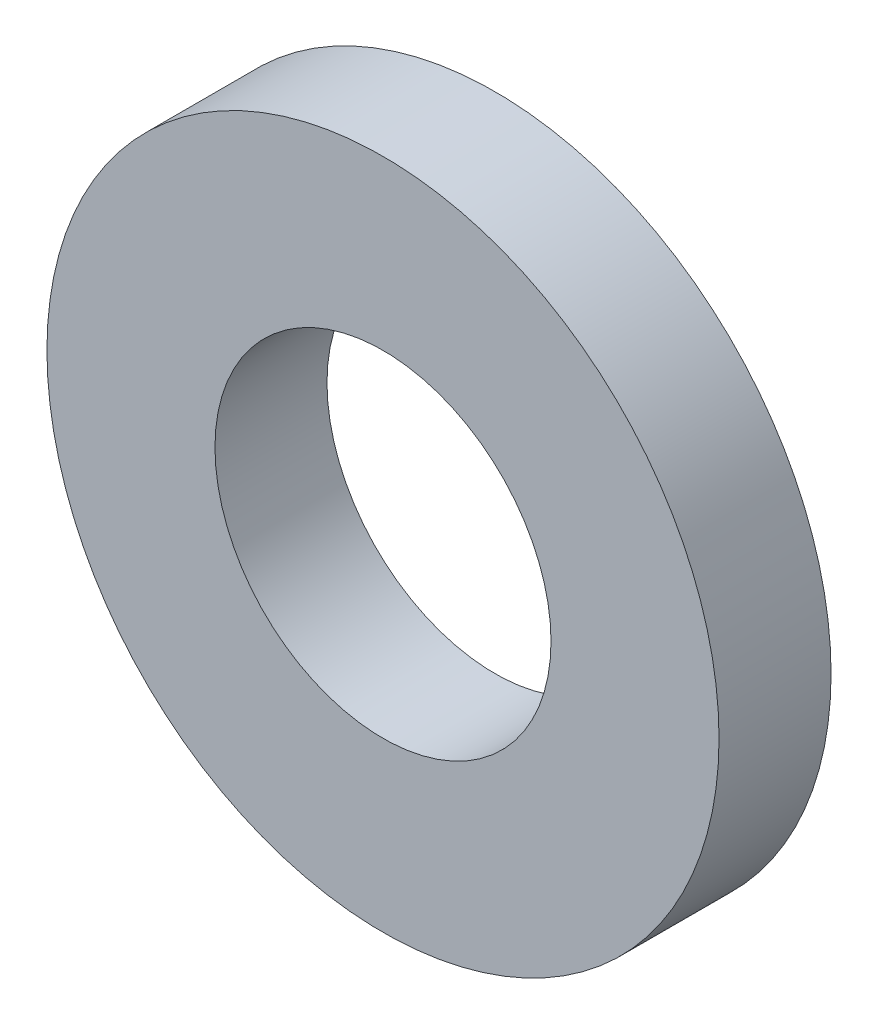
ISO-10303-21;
HEADER;
FILE_DESCRIPTION(('STEP AP214'),'2;1');
FILE_NAME('part.step','',(''),(''),'','','');
FILE_SCHEMA(('AUTOMOTIVE_DESIGN { 1 0 10303 214 1 1 1 1 }'));
ENDSEC;
DATA;
#1=APPLICATION_CONTEXT('core data for automotive mechanical design processes');
#2=APPLICATION_PROTOCOL_DEFINITION('international standard','automotive_design',2000,#1);
#3=PRODUCT_CONTEXT('',#1,'mechanical');
#4=PRODUCT('Part','Part','',(#3));
#5=PRODUCT_RELATED_PRODUCT_CATEGORY('part','',(#4));
#6=PRODUCT_DEFINITION_FORMATION('','',#4);
#7=PRODUCT_DEFINITION_CONTEXT('part definition',#1,'design');
#8=PRODUCT_DEFINITION('design','',#6,#7);
#9=PRODUCT_DEFINITION_SHAPE('','',#8);
#10=(LENGTH_UNIT() NAMED_UNIT(*) SI_UNIT(.MILLI.,.METRE.));
#11=(NAMED_UNIT(*) PLANE_ANGLE_UNIT() SI_UNIT($,.RADIAN.));
#12=(NAMED_UNIT(*) SI_UNIT($,.STERADIAN.) SOLID_ANGLE_UNIT());
#13=UNCERTAINTY_MEASURE_WITH_UNIT(LENGTH_MEASURE(1.E-05),#10,'distance_accuracy_value','');
#14=(GEOMETRIC_REPRESENTATION_CONTEXT(3) GLOBAL_UNCERTAINTY_ASSIGNED_CONTEXT((#13)) GLOBAL_UNIT_ASSIGNED_CONTEXT((#10,
#11,#12)) REPRESENTATION_CONTEXT('',''));
#15=CARTESIAN_POINT('',(0.,0.,0.));
#16=DIRECTION('',(0.,0.,1.));
#17=DIRECTION('',(1.,0.,0.));
#18=AXIS2_PLACEMENT_3D('',#15,#16,#17);
#19=CARTESIAN_POINT('',(0.,0.,3.));
#20=DIRECTION('',(0.,0.,1.));
#21=DIRECTION('',(1.,0.,0.));
#22=AXIS2_PLACEMENT_3D('',#19,#20,#21);
#23=PLANE('',#22);
#24=CARTESIAN_POINT('',(0.,0.,3.));
#25=DIRECTION('',(0.,0.,1.));
#26=DIRECTION('',(1.,0.,0.));
#27=AXIS2_PLACEMENT_3D('',#24,#25,#26);
#28=CIRCLE('',#27,9.);
#29=CARTESIAN_POINT('',(9.,0.,3.));
#30=VERTEX_POINT('',#29);
#31=EDGE_CURVE('E10',#30,#30,#28,.T.);
#32=ORIENTED_EDGE('',*,*,#31,.T.);
#33=EDGE_LOOP('',(#32));
#34=FACE_BOUND('',#33,.T.);
#35=CARTESIAN_POINT('',(0.,0.,3.));
#36=DIRECTION('',(0.,0.,1.));
#37=DIRECTION('',(1.,0.,0.));
#38=AXIS2_PLACEMENT_3D('',#35,#36,#37);
#39=CIRCLE('',#38,4.5);
#40=CARTESIAN_POINT('',(4.5,0.,3.));
#41=VERTEX_POINT('',#40);
#42=EDGE_CURVE('E44',#41,#41,#39,.T.);
#43=ORIENTED_EDGE('',*,*,#42,.F.);
#44=EDGE_LOOP('',(#43));
#45=FACE_BOUND('',#44,.T.);
#46=ADVANCED_FACE('F33',(#34,#45),#23,.T.);
#47=CARTESIAN_POINT('',(0.,0.,0.));
#48=DIRECTION('',(0.,0.,1.));
#49=DIRECTION('',(1.,0.,0.));
#50=AXIS2_PLACEMENT_3D('',#47,#48,#49);
#51=PLANE('',#50);
#52=CARTESIAN_POINT('',(0.,0.,0.));
#53=DIRECTION('',(0.,0.,1.));
#54=DIRECTION('',(1.,0.,0.));
#55=AXIS2_PLACEMENT_3D('',#52,#53,#54);
#56=CIRCLE('',#55,9.);
#57=CARTESIAN_POINT('',(9.,0.,0.));
#58=VERTEX_POINT('',#57);
#59=EDGE_CURVE('E37',#58,#58,#56,.T.);
#60=ORIENTED_EDGE('',*,*,#59,.F.);
#61=EDGE_LOOP('',(#60));
#62=FACE_BOUND('',#61,.T.);
#63=CARTESIAN_POINT('',(0.,0.,0.));
#64=DIRECTION('',(0.,0.,1.));
#65=DIRECTION('',(1.,0.,0.));
#66=AXIS2_PLACEMENT_3D('',#63,#64,#65);
#67=CIRCLE('',#66,4.5);
#68=CARTESIAN_POINT('',(4.5,0.,0.));
#69=VERTEX_POINT('',#68);
#70=EDGE_CURVE('E46',#69,#69,#67,.T.);
#71=ORIENTED_EDGE('',*,*,#70,.T.);
#72=EDGE_LOOP('',(#71));
#73=FACE_BOUND('',#72,.T.);
#74=ADVANCED_FACE('F56',(#62,#73),#51,.F.);
#75=CARTESIAN_POINT('',(0.,0.,3.));
#76=DIRECTION('',(0.,0.,-1.));
#77=DIRECTION('',(-1.,0.,0.));
#78=AXIS2_PLACEMENT_3D('',#75,#76,#77);
#79=CYLINDRICAL_SURFACE('',#78,9.);
#80=ORIENTED_EDGE('',*,*,#31,.F.);
#81=EDGE_LOOP('',(#80));
#82=FACE_BOUND('',#81,.T.);
#83=ORIENTED_EDGE('',*,*,#59,.T.);
#84=EDGE_LOOP('',(#83));
#85=FACE_BOUND('',#84,.T.);
#86=ADVANCED_FACE('F35',(#82,#85),#79,.T.);
#87=CARTESIAN_POINT('',(0.,0.,3.));
#88=DIRECTION('',(0.,0.,-1.));
#89=DIRECTION('',(-1.,0.,0.));
#90=AXIS2_PLACEMENT_3D('',#87,#88,#89);
#91=CYLINDRICAL_SURFACE('',#90,4.5);
#92=ORIENTED_EDGE('',*,*,#42,.T.);
#93=EDGE_LOOP('',(#92));
#94=FACE_BOUND('',#93,.T.);
#95=ORIENTED_EDGE('',*,*,#70,.F.);
#96=EDGE_LOOP('',(#95));
#97=FACE_BOUND('',#96,.T.);
#98=ADVANCED_FACE('F52',(#94,#97),#91,.F.);
#99=CLOSED_SHELL('',(#46,#74,#86,#98));
#100=MANIFOLD_SOLID_BREP('B2',#99);
#101=ADVANCED_BREP_SHAPE_REPRESENTATION('',(#18,#100),#14);
#102=SHAPE_DEFINITION_REPRESENTATION(#9,#101);
ENDSEC;
END-ISO-10303-21;
